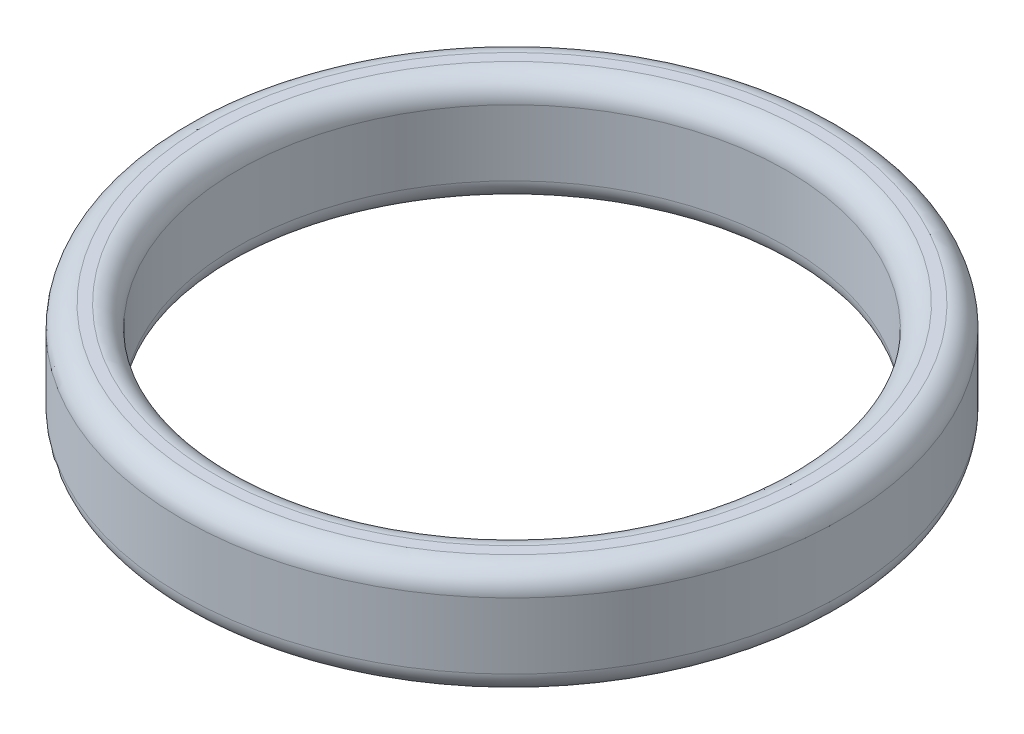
ISO-10303-21;
HEADER;
FILE_DESCRIPTION(('STEP AP214'),'2;1');
FILE_NAME('part.step','',(''),(''),'','','');
FILE_SCHEMA(('AUTOMOTIVE_DESIGN { 1 0 10303 214 1 1 1 1 }'));
ENDSEC;
DATA;
#1=APPLICATION_CONTEXT('core data for automotive mechanical design processes');
#2=APPLICATION_PROTOCOL_DEFINITION('international standard','automotive_design',2000,#1);
#3=PRODUCT_CONTEXT('',#1,'mechanical');
#4=PRODUCT('Part','Part','',(#3));
#5=PRODUCT_RELATED_PRODUCT_CATEGORY('part','',(#4));
#6=PRODUCT_DEFINITION_FORMATION('','',#4);
#7=PRODUCT_DEFINITION_CONTEXT('part definition',#1,'design');
#8=PRODUCT_DEFINITION('design','',#6,#7);
#9=PRODUCT_DEFINITION_SHAPE('','',#8);
#10=(LENGTH_UNIT() NAMED_UNIT(*) SI_UNIT(.MILLI.,.METRE.));
#11=(NAMED_UNIT(*) PLANE_ANGLE_UNIT() SI_UNIT($,.RADIAN.));
#12=(NAMED_UNIT(*) SI_UNIT($,.STERADIAN.) SOLID_ANGLE_UNIT());
#13=UNCERTAINTY_MEASURE_WITH_UNIT(LENGTH_MEASURE(1.E-05),#10,'distance_accuracy_value','');
#14=(GEOMETRIC_REPRESENTATION_CONTEXT(3) GLOBAL_UNCERTAINTY_ASSIGNED_CONTEXT((#13)) GLOBAL_UNIT_ASSIGNED_CONTEXT((#10,
#11,#12)) REPRESENTATION_CONTEXT('',''));
#15=CARTESIAN_POINT('',(0.,0.,0.));
#16=DIRECTION('',(0.,0.,1.));
#17=DIRECTION('',(1.,0.,0.));
#18=AXIS2_PLACEMENT_3D('',#15,#16,#17);
#19=CARTESIAN_POINT('',(0.,0.9,0.));
#20=DIRECTION('',(0.,-1.,0.));
#21=DIRECTION('',(0.,0.,-1.));
#22=AXIS2_PLACEMENT_3D('',#19,#20,#21);
#23=TOROIDAL_SURFACE('',#22,5.6,0.4);
#24=CARTESIAN_POINT('',(0.,0.9,0.));
#25=DIRECTION('',(0.,-1.,0.));
#26=DIRECTION('',(0.,0.,-1.));
#27=AXIS2_PLACEMENT_3D('',#24,#25,#26);
#28=CIRCLE('',#27,6.);
#29=CARTESIAN_POINT('',(0.,0.9,-6.));
#30=VERTEX_POINT('',#29);
#31=EDGE_CURVE('E58',#30,#30,#28,.T.);
#32=ORIENTED_EDGE('',*,*,#31,.T.);
#33=EDGE_LOOP('',(#32));
#34=FACE_BOUND('',#33,.T.);
#35=CARTESIAN_POINT('',(0.,0.5,0.));
#36=DIRECTION('',(0.,-1.,0.));
#37=DIRECTION('',(0.,0.,-1.));
#38=AXIS2_PLACEMENT_3D('',#35,#36,#37);
#39=CIRCLE('',#38,5.6);
#40=CARTESIAN_POINT('',(0.,0.5,-5.6));
#41=VERTEX_POINT('',#40);
#42=EDGE_CURVE('E10',#41,#41,#39,.T.);
#43=ORIENTED_EDGE('',*,*,#42,.F.);
#44=EDGE_LOOP('',(#43));
#45=FACE_BOUND('',#44,.T.);
#46=ADVANCED_FACE('F30',(#34,#45),#23,.T.);
#47=CARTESIAN_POINT('',(5.4,0.5,0.));
#48=DIRECTION('',(0.,-1.,0.));
#49=DIRECTION('',(0.,0.,-1.));
#50=AXIS2_PLACEMENT_3D('',#47,#48,#49);
#51=PLANE('',#50);
#52=ORIENTED_EDGE('',*,*,#42,.T.);
#53=EDGE_LOOP('',(#52));
#54=FACE_BOUND('',#53,.T.);
#55=CARTESIAN_POINT('',(0.,0.5,0.));
#56=DIRECTION('',(0.,-1.,0.));
#57=DIRECTION('',(0.,0.,-1.));
#58=AXIS2_PLACEMENT_3D('',#55,#56,#57);
#59=CIRCLE('',#58,5.4);
#60=CARTESIAN_POINT('',(0.,0.5,-5.4));
#61=VERTEX_POINT('',#60);
#62=EDGE_CURVE('E36',#61,#61,#59,.T.);
#63=ORIENTED_EDGE('',*,*,#62,.F.);
#64=EDGE_LOOP('',(#63));
#65=FACE_BOUND('',#64,.T.);
#66=ADVANCED_FACE('F76',(#54,#65),#51,.T.);
#67=CARTESIAN_POINT('',(0.,0.9,0.));
#68=DIRECTION('',(0.,-1.,0.));
#69=DIRECTION('',(0.,0.,-1.));
#70=AXIS2_PLACEMENT_3D('',#67,#68,#69);
#71=TOROIDAL_SURFACE('',#70,5.4,0.4);
#72=ORIENTED_EDGE('',*,*,#62,.T.);
#73=EDGE_LOOP('',(#72));
#74=FACE_BOUND('',#73,.T.);
#75=CARTESIAN_POINT('',(0.,0.9,0.));
#76=DIRECTION('',(0.,-1.,0.));
#77=DIRECTION('',(0.,0.,-1.));
#78=AXIS2_PLACEMENT_3D('',#75,#76,#77);
#79=CIRCLE('',#78,5.);
#80=CARTESIAN_POINT('',(0.,0.9,-5.));
#81=VERTEX_POINT('',#80);
#82=EDGE_CURVE('E40',#81,#81,#79,.T.);
#83=ORIENTED_EDGE('',*,*,#82,.F.);
#84=EDGE_LOOP('',(#83));
#85=FACE_BOUND('',#84,.T.);
#86=ADVANCED_FACE('F80',(#74,#85),#71,.T.);
#87=CARTESIAN_POINT('',(0.,0.,0.));
#88=DIRECTION('',(0.,-1.,0.));
#89=DIRECTION('',(0.,0.,-1.));
#90=AXIS2_PLACEMENT_3D('',#87,#88,#89);
#91=CYLINDRICAL_SURFACE('',#90,5.);
#92=ORIENTED_EDGE('',*,*,#82,.T.);
#93=EDGE_LOOP('',(#92));
#94=FACE_BOUND('',#93,.T.);
#95=CARTESIAN_POINT('',(0.,2.1,0.));
#96=DIRECTION('',(0.,-1.,0.));
#97=DIRECTION('',(0.,0.,-1.));
#98=AXIS2_PLACEMENT_3D('',#95,#96,#97);
#99=CIRCLE('',#98,5.);
#100=CARTESIAN_POINT('',(0.,2.1,-5.));
#101=VERTEX_POINT('',#100);
#102=EDGE_CURVE('E44',#101,#101,#99,.T.);
#103=ORIENTED_EDGE('',*,*,#102,.F.);
#104=EDGE_LOOP('',(#103));
#105=FACE_BOUND('',#104,.T.);
#106=ADVANCED_FACE('F84',(#94,#105),#91,.F.);
#107=CARTESIAN_POINT('',(0.,2.1,0.));
#108=DIRECTION('',(0.,-1.,0.));
#109=DIRECTION('',(0.,0.,-1.));
#110=AXIS2_PLACEMENT_3D('',#107,#108,#109);
#111=TOROIDAL_SURFACE('',#110,5.4,0.4);
#112=ORIENTED_EDGE('',*,*,#102,.T.);
#113=EDGE_LOOP('',(#112));
#114=FACE_BOUND('',#113,.T.);
#115=CARTESIAN_POINT('',(0.,2.5,0.));
#116=DIRECTION('',(0.,-1.,0.));
#117=DIRECTION('',(0.,0.,-1.));
#118=AXIS2_PLACEMENT_3D('',#115,#116,#117);
#119=CIRCLE('',#118,5.4);
#120=CARTESIAN_POINT('',(0.,2.5,-5.4));
#121=VERTEX_POINT('',#120);
#122=EDGE_CURVE('E49',#121,#121,#119,.T.);
#123=ORIENTED_EDGE('',*,*,#122,.F.);
#124=EDGE_LOOP('',(#123));
#125=FACE_BOUND('',#124,.T.);
#126=ADVANCED_FACE('F90',(#114,#125),#111,.T.);
#127=CARTESIAN_POINT('',(5.4,2.5,0.));
#128=DIRECTION('',(0.,1.,0.));
#129=DIRECTION('',(0.,0.,1.));
#130=AXIS2_PLACEMENT_3D('',#127,#128,#129);
#131=PLANE('',#130);
#132=ORIENTED_EDGE('',*,*,#122,.T.);
#133=EDGE_LOOP('',(#132));
#134=FACE_BOUND('',#133,.T.);
#135=CARTESIAN_POINT('',(0.,2.5,0.));
#136=DIRECTION('',(0.,-1.,0.));
#137=DIRECTION('',(0.,0.,-1.));
#138=AXIS2_PLACEMENT_3D('',#135,#136,#137);
#139=CIRCLE('',#138,5.6);
#140=CARTESIAN_POINT('',(0.,2.5,-5.6));
#141=VERTEX_POINT('',#140);
#142=EDGE_CURVE('E52',#141,#141,#139,.T.);
#143=ORIENTED_EDGE('',*,*,#142,.F.);
#144=EDGE_LOOP('',(#143));
#145=FACE_BOUND('',#144,.T.);
#146=ADVANCED_FACE('F72',(#134,#145),#131,.T.);
#147=CARTESIAN_POINT('',(0.,2.1,0.));
#148=DIRECTION('',(0.,-1.,0.));
#149=DIRECTION('',(0.,0.,-1.));
#150=AXIS2_PLACEMENT_3D('',#147,#148,#149);
#151=TOROIDAL_SURFACE('',#150,5.6,0.4);
#152=ORIENTED_EDGE('',*,*,#142,.T.);
#153=EDGE_LOOP('',(#152));
#154=FACE_BOUND('',#153,.T.);
#155=CARTESIAN_POINT('',(0.,2.1,0.));
#156=DIRECTION('',(0.,-1.,0.));
#157=DIRECTION('',(0.,0.,-1.));
#158=AXIS2_PLACEMENT_3D('',#155,#156,#157);
#159=CIRCLE('',#158,6.);
#160=CARTESIAN_POINT('',(0.,2.1,-6.));
#161=VERTEX_POINT('',#160);
#162=EDGE_CURVE('E55',#161,#161,#159,.T.);
#163=ORIENTED_EDGE('',*,*,#162,.F.);
#164=EDGE_LOOP('',(#163));
#165=FACE_BOUND('',#164,.T.);
#166=ADVANCED_FACE('F66',(#154,#165),#151,.T.);
#167=CARTESIAN_POINT('',(0.,0.,0.));
#168=DIRECTION('',(0.,-1.,0.));
#169=DIRECTION('',(0.,0.,-1.));
#170=AXIS2_PLACEMENT_3D('',#167,#168,#169);
#171=CYLINDRICAL_SURFACE('',#170,6.);
#172=ORIENTED_EDGE('',*,*,#162,.T.);
#173=EDGE_LOOP('',(#172));
#174=FACE_BOUND('',#173,.T.);
#175=ORIENTED_EDGE('',*,*,#31,.F.);
#176=EDGE_LOOP('',(#175));
#177=FACE_BOUND('',#176,.T.);
#178=ADVANCED_FACE('F64',(#174,#177),#171,.T.);
#179=CLOSED_SHELL('',(#46,#66,#86,#106,#126,#146,#166,#178));
#180=MANIFOLD_SOLID_BREP('B2',#179);
#181=ADVANCED_BREP_SHAPE_REPRESENTATION('',(#18,#180),#14);
#182=SHAPE_DEFINITION_REPRESENTATION(#9,#181);
ENDSEC;
END-ISO-10303-21;
